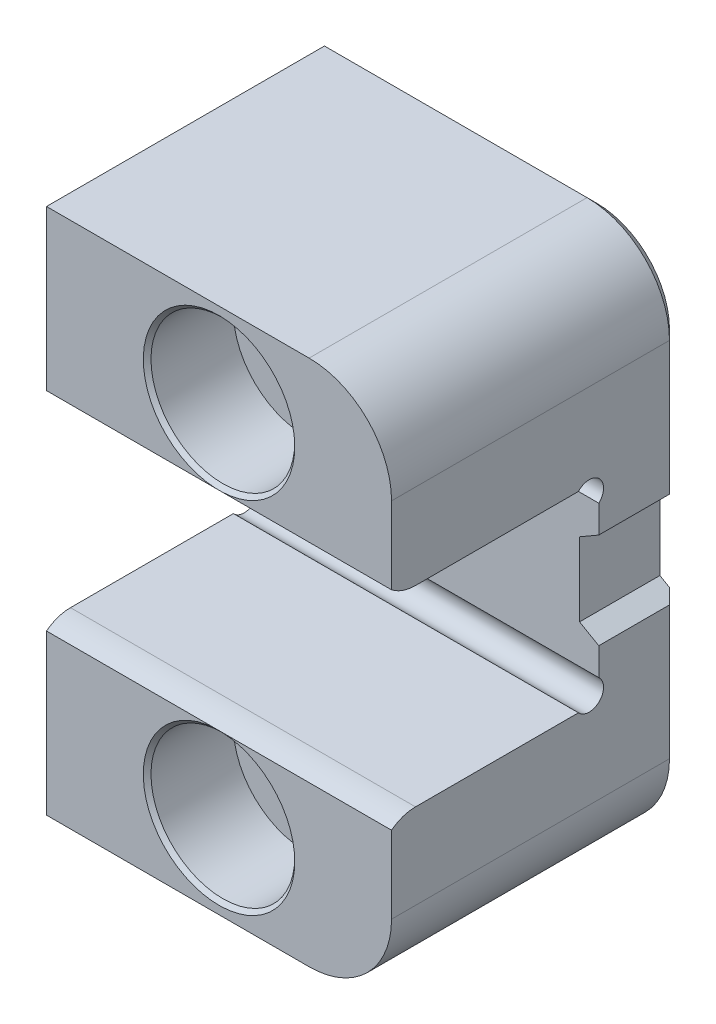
ISO-10303-21;
HEADER;
FILE_DESCRIPTION(('STEP AP214'),'2;1');
FILE_NAME('part.step','',(''),(''),'','','');
FILE_SCHEMA(('AUTOMOTIVE_DESIGN { 1 0 10303 214 1 1 1 1 }'));
ENDSEC;
DATA;
#1=APPLICATION_CONTEXT('core data for automotive mechanical design processes');
#2=APPLICATION_PROTOCOL_DEFINITION('international standard','automotive_design',2000,#1);
#3=PRODUCT_CONTEXT('',#1,'mechanical');
#4=PRODUCT('Part','Part','',(#3));
#5=PRODUCT_RELATED_PRODUCT_CATEGORY('part','',(#4));
#6=PRODUCT_DEFINITION_FORMATION('','',#4);
#7=PRODUCT_DEFINITION_CONTEXT('part definition',#1,'design');
#8=PRODUCT_DEFINITION('design','',#6,#7);
#9=PRODUCT_DEFINITION_SHAPE('','',#8);
#10=(LENGTH_UNIT() NAMED_UNIT(*) SI_UNIT(.MILLI.,.METRE.));
#11=(NAMED_UNIT(*) PLANE_ANGLE_UNIT() SI_UNIT($,.RADIAN.));
#12=(NAMED_UNIT(*) SI_UNIT($,.STERADIAN.) SOLID_ANGLE_UNIT());
#13=UNCERTAINTY_MEASURE_WITH_UNIT(LENGTH_MEASURE(1.E-05),#10,'distance_accuracy_value','');
#14=(GEOMETRIC_REPRESENTATION_CONTEXT(3) GLOBAL_UNCERTAINTY_ASSIGNED_CONTEXT((#13)) GLOBAL_UNIT_ASSIGNED_CONTEXT((#10,
#11,#12)) REPRESENTATION_CONTEXT('',''));
#15=CARTESIAN_POINT('',(0.,0.,0.));
#16=DIRECTION('',(0.,0.,1.));
#17=DIRECTION('',(1.,0.,0.));
#18=AXIS2_PLACEMENT_3D('',#15,#16,#17);
#19=CARTESIAN_POINT('',(18.,-27.5,0.));
#20=DIRECTION('',(1.,0.,0.));
#21=DIRECTION('',(0.,0.,-1.));
#22=AXIS2_PLACEMENT_3D('',#19,#20,#21);
#23=PLANE('',#22);
#24=DIRECTION('',(0.,0.,-1.));
#25=VECTOR('',#24,1.);
#26=CARTESIAN_POINT('',(18.,-18.9,-30.));
#27=LINE('',#26,#25);
#28=CARTESIAN_POINT('',(18.,-18.9,0.));
#29=VERTEX_POINT('',#28);
#30=CARTESIAN_POINT('',(18.,-18.9,-29.));
#31=VERTEX_POINT('',#30);
#32=EDGE_CURVE('E247',#29,#31,#27,.T.);
#33=ORIENTED_EDGE('',*,*,#32,.T.);
#34=DIRECTION('',(0.,1.,0.));
#35=VECTOR('',#34,1.);
#36=CARTESIAN_POINT('',(18.,-5.,-29.));
#37=LINE('',#36,#35);
#38=CARTESIAN_POINT('',(18.,-5.,-29.));
#39=VERTEX_POINT('',#38);
#40=EDGE_CURVE('E263',#31,#39,#37,.T.);
#41=ORIENTED_EDGE('',*,*,#40,.T.);
#42=DIRECTION('',(0.,0.,1.));
#43=VECTOR('',#42,1.);
#44=CARTESIAN_POINT('',(18.,-5.,-30.));
#45=LINE('',#44,#43);
#46=CARTESIAN_POINT('',(18.,-5.,-21.62));
#47=VERTEX_POINT('',#46);
#48=EDGE_CURVE('E435',#39,#47,#45,.T.);
#49=ORIENTED_EDGE('',*,*,#48,.T.);
#50=DIRECTION('',(0.,-1.,0.));
#51=VECTOR('',#50,1.);
#52=CARTESIAN_POINT('',(18.,10.,-21.62));
#53=LINE('',#52,#51);
#54=CARTESIAN_POINT('',(18.,-7.8819660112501,-21.62));
#55=VERTEX_POINT('',#54);
#56=EDGE_CURVE('E467',#47,#55,#53,.T.);
#57=ORIENTED_EDGE('',*,*,#56,.T.);
#58=CARTESIAN_POINT('',(18.,-9.,-20.62));
#59=DIRECTION('',(1.,0.,0.));
#60=DIRECTION('',(0.,0.,1.));
#61=AXIS2_PLACEMENT_3D('',#58,#59,#60);
#62=CIRCLE('',#61,1.5);
#63=CARTESIAN_POINT('',(18.,-10.,-19.5019660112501));
#64=VERTEX_POINT('',#63);
#65=EDGE_CURVE('E206',#64,#55,#62,.T.);
#66=ORIENTED_EDGE('',*,*,#65,.F.);
#67=DIRECTION('',(0.,0.,1.));
#68=VECTOR('',#67,1.);
#69=CARTESIAN_POINT('',(18.,-10.,-21.62));
#70=LINE('',#69,#68);
#71=CARTESIAN_POINT('',(18.,-10.,-2.49999999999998));
#72=VERTEX_POINT('',#71);
#73=EDGE_CURVE('E214',#64,#72,#70,.T.);
#74=ORIENTED_EDGE('',*,*,#73,.T.);
#75=CARTESIAN_POINT('',(18.,-14.0673190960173,-2.49999998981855));
#76=DIRECTION('',(-1.,0.,0.));
#77=DIRECTION('',(0.,0.,1.));
#78=AXIS2_PLACEMENT_3D('',#75,#76,#77);
#79=CIRCLE('',#78,4.06731909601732);
#80=CARTESIAN_POINT('',(18.,-10.859035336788,0.));
#81=VERTEX_POINT('',#80);
#82=EDGE_CURVE('E502',#81,#72,#79,.T.);
#83=ORIENTED_EDGE('',*,*,#82,.F.);
#84=DIRECTION('',(0.,-1.,0.));
#85=VECTOR('',#84,1.);
#86=CARTESIAN_POINT('',(18.,-10.,0.));
#87=LINE('',#86,#85);
#88=EDGE_CURVE('E242',#81,#29,#87,.T.);
#89=ORIENTED_EDGE('',*,*,#88,.T.);
#90=EDGE_LOOP('',(#33,#41,#49,#57,#66,#74,#83,#89));
#91=FACE_BOUND('',#90,.T.);
#92=ADVANCED_FACE('F33',(#91),#23,.T.);
#93=CARTESIAN_POINT('',(18.,27.5,0.));
#94=DIRECTION('',(0.,0.,-1.));
#95=DIRECTION('',(0.,1.,0.));
#96=AXIS2_PLACEMENT_3D('',#93,#94,#95);
#97=PLANE('',#96);
#98=DIRECTION('',(1.,0.,0.));
#99=VECTOR('',#98,1.);
#100=CARTESIAN_POINT('',(-18.,10.859035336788,0.));
#101=LINE('',#100,#99);
#102=CARTESIAN_POINT('',(-18.,10.859035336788,0.));
#103=VERTEX_POINT('',#102);
#104=CARTESIAN_POINT('',(-0.377725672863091,10.859035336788,0.));
#105=VERTEX_POINT('',#104);
#106=EDGE_CURVE('E503',#103,#105,#101,.T.);
#107=ORIENTED_EDGE('',*,*,#106,.T.);
#108=CARTESIAN_POINT('',(0.,18.75,0.));
#109=DIRECTION('',(0.,0.,-1.));
#110=DIRECTION('',(0.,1.,0.));
#111=AXIS2_PLACEMENT_3D('',#108,#109,#110);
#112=CIRCLE('',#111,7.9);
#113=CARTESIAN_POINT('',(0.377725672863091,10.859035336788,0.));
#114=VERTEX_POINT('',#113);
#115=EDGE_CURVE('E46',#105,#114,#112,.T.);
#116=ORIENTED_EDGE('',*,*,#115,.T.);
#117=CARTESIAN_POINT('',(18.,10.859035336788,0.));
#118=VERTEX_POINT('',#117);
#119=EDGE_CURVE('E498',#114,#118,#101,.T.);
#120=ORIENTED_EDGE('',*,*,#119,.T.);
#121=DIRECTION('',(0.,-1.,0.));
#122=VECTOR('',#121,1.);
#123=CARTESIAN_POINT('',(18.,27.5,0.));
#124=LINE('',#123,#122);
#125=CARTESIAN_POINT('',(18.,18.9,0.));
#126=VERTEX_POINT('',#125);
#127=EDGE_CURVE('E237',#126,#118,#124,.T.);
#128=ORIENTED_EDGE('',*,*,#127,.F.);
#129=CARTESIAN_POINT('',(9.4,18.9,0.));
#130=DIRECTION('',(0.,0.,-1.));
#131=DIRECTION('',(0.,1.,0.));
#132=AXIS2_PLACEMENT_3D('',#129,#130,#131);
#133=CIRCLE('',#132,8.6);
#134=CARTESIAN_POINT('',(9.4,27.5,0.));
#135=VERTEX_POINT('',#134);
#136=EDGE_CURVE('E255',#126,#135,#133,.F.);
#137=ORIENTED_EDGE('',*,*,#136,.T.);
#138=DIRECTION('',(-1.,0.,0.));
#139=VECTOR('',#138,1.);
#140=CARTESIAN_POINT('',(18.,27.5,0.));
#141=LINE('',#140,#139);
#142=CARTESIAN_POINT('',(-18.,27.5,0.));
#143=VERTEX_POINT('',#142);
#144=EDGE_CURVE('E238',#135,#143,#141,.T.);
#145=ORIENTED_EDGE('',*,*,#144,.T.);
#146=DIRECTION('',(0.,-1.,0.));
#147=VECTOR('',#146,1.);
#148=CARTESIAN_POINT('',(-18.,27.5,0.));
#149=LINE('',#148,#147);
#150=EDGE_CURVE('E461',#143,#103,#149,.T.);
#151=ORIENTED_EDGE('',*,*,#150,.T.);
#152=EDGE_LOOP('',(#107,#116,#120,#128,#137,#145,#151));
#153=FACE_BOUND('',#152,.T.);
#154=ADVANCED_FACE('F378',(#153),#97,.F.);
#155=CARTESIAN_POINT('',(18.,10.,0.));
#156=DIRECTION('',(0.,1.,0.));
#157=DIRECTION('',(0.,0.,1.));
#158=AXIS2_PLACEMENT_3D('',#155,#156,#157);
#159=PLANE('',#158);
#160=DIRECTION('',(0.,0.,-1.));
#161=VECTOR('',#160,1.);
#162=CARTESIAN_POINT('',(-18.,10.,0.));
#163=LINE('',#162,#161);
#164=CARTESIAN_POINT('',(-18.,10.,-2.49999999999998));
#165=VERTEX_POINT('',#164);
#166=CARTESIAN_POINT('',(-18.,10.,-19.5019660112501));
#167=VERTEX_POINT('',#166);
#168=EDGE_CURVE('E226',#165,#167,#163,.T.);
#169=ORIENTED_EDGE('',*,*,#168,.T.);
#170=DIRECTION('',(1.,0.,0.));
#171=VECTOR('',#170,1.);
#172=CARTESIAN_POINT('',(-18.,10.,-19.5019660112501));
#173=LINE('',#172,#171);
#174=CARTESIAN_POINT('',(18.,10.,-19.5019660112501));
#175=VERTEX_POINT('',#174);
#176=EDGE_CURVE('E479',#167,#175,#173,.T.);
#177=ORIENTED_EDGE('',*,*,#176,.T.);
#178=DIRECTION('',(0.,0.,-1.));
#179=VECTOR('',#178,1.);
#180=CARTESIAN_POINT('',(18.,10.,0.));
#181=LINE('',#180,#179);
#182=CARTESIAN_POINT('',(18.,10.,-2.49999999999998));
#183=VERTEX_POINT('',#182);
#184=EDGE_CURVE('E464',#183,#175,#181,.T.);
#185=ORIENTED_EDGE('',*,*,#184,.F.);
#186=DIRECTION('',(1.,0.,0.));
#187=VECTOR('',#186,1.);
#188=CARTESIAN_POINT('',(-18.,10.,-2.49999999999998));
#189=LINE('',#188,#187);
#190=EDGE_CURVE('E480',#165,#183,#189,.T.);
#191=ORIENTED_EDGE('',*,*,#190,.F.);
#192=EDGE_LOOP('',(#169,#177,#185,#191));
#193=FACE_BOUND('',#192,.T.);
#194=ADVANCED_FACE('F374',(#193),#159,.F.);
#195=CARTESIAN_POINT('',(18.,10.,-21.62));
#196=DIRECTION('',(0.,0.,-1.));
#197=DIRECTION('',(-1.,0.,0.));
#198=AXIS2_PLACEMENT_3D('',#195,#196,#197);
#199=PLANE('',#198);
#200=DIRECTION('',(0.,-1.,0.));
#201=VECTOR('',#200,1.);
#202=CARTESIAN_POINT('',(-18.,10.,-21.62));
#203=LINE('',#202,#201);
#204=CARTESIAN_POINT('',(-18.,7.8819660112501,-21.62));
#205=VERTEX_POINT('',#204);
#206=CARTESIAN_POINT('',(-18.,-7.8819660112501,-21.62));
#207=VERTEX_POINT('',#206);
#208=EDGE_CURVE('E222',#205,#207,#203,.T.);
#209=ORIENTED_EDGE('',*,*,#208,.T.);
#210=DIRECTION('',(1.,0.,0.));
#211=VECTOR('',#210,1.);
#212=CARTESIAN_POINT('',(-18.,-7.8819660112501,-21.62));
#213=LINE('',#212,#211);
#214=EDGE_CURVE('E201',#207,#55,#213,.T.);
#215=ORIENTED_EDGE('',*,*,#214,.T.);
#216=ORIENTED_EDGE('',*,*,#56,.F.);
#217=DIRECTION('',(-0.866025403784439,0.5,0.));
#218=VECTOR('',#217,1.);
#219=CARTESIAN_POINT('',(11.5048094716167,-1.25,-21.62));
#220=LINE('',#219,#218);
#221=CARTESIAN_POINT('',(16.,-3.84529946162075,-21.62));
#222=VERTEX_POINT('',#221);
#223=EDGE_CURVE('E455',#47,#222,#220,.T.);
#224=ORIENTED_EDGE('',*,*,#223,.T.);
#225=DIRECTION('',(0.,1.,0.));
#226=VECTOR('',#225,1.);
#227=CARTESIAN_POINT('',(16.,10.,-21.62));
#228=LINE('',#227,#226);
#229=CARTESIAN_POINT('',(16.,3.84529946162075,-21.62));
#230=VERTEX_POINT('',#229);
#231=EDGE_CURVE('E458',#222,#230,#228,.T.);
#232=ORIENTED_EDGE('',*,*,#231,.T.);
#233=DIRECTION('',(0.866025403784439,0.5,0.));
#234=VECTOR('',#233,1.);
#235=CARTESIAN_POINT('',(20.1650635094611,6.25,-21.62));
#236=LINE('',#235,#234);
#237=CARTESIAN_POINT('',(18.,5.,-21.62));
#238=VERTEX_POINT('',#237);
#239=EDGE_CURVE('E448',#230,#238,#236,.T.);
#240=ORIENTED_EDGE('',*,*,#239,.T.);
#241=CARTESIAN_POINT('',(18.,7.8819660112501,-21.62));
#242=VERTEX_POINT('',#241);
#243=EDGE_CURVE('E468',#242,#238,#53,.T.);
#244=ORIENTED_EDGE('',*,*,#243,.F.);
#245=DIRECTION('',(1.,0.,0.));
#246=VECTOR('',#245,1.);
#247=CARTESIAN_POINT('',(-18.,7.8819660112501,-21.62));
#248=LINE('',#247,#246);
#249=EDGE_CURVE('E487',#242,#205,#248,.F.);
#250=ORIENTED_EDGE('',*,*,#249,.T.);
#251=EDGE_LOOP('',(#209,#215,#216,#224,#232,#240,#244,#250));
#252=FACE_BOUND('',#251,.T.);
#253=ADVANCED_FACE('F371',(#252),#199,.F.);
#254=CARTESIAN_POINT('',(18.,-10.,-21.62));
#255=DIRECTION('',(0.,-1.,0.));
#256=DIRECTION('',(0.,0.,-1.));
#257=AXIS2_PLACEMENT_3D('',#254,#255,#256);
#258=PLANE('',#257);
#259=ORIENTED_EDGE('',*,*,#73,.F.);
#260=DIRECTION('',(1.,0.,0.));
#261=VECTOR('',#260,1.);
#262=CARTESIAN_POINT('',(-18.,-10.,-19.5019660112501));
#263=LINE('',#262,#261);
#264=CARTESIAN_POINT('',(-18.,-10.,-19.5019660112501));
#265=VERTEX_POINT('',#264);
#266=EDGE_CURVE('E198',#64,#265,#263,.F.);
#267=ORIENTED_EDGE('',*,*,#266,.T.);
#268=DIRECTION('',(0.,0.,1.));
#269=VECTOR('',#268,1.);
#270=CARTESIAN_POINT('',(-18.,-10.,-21.62));
#271=LINE('',#270,#269);
#272=CARTESIAN_POINT('',(-18.,-10.,-2.49999999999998));
#273=VERTEX_POINT('',#272);
#274=EDGE_CURVE('E212',#265,#273,#271,.T.);
#275=ORIENTED_EDGE('',*,*,#274,.T.);
#276=DIRECTION('',(1.,0.,0.));
#277=VECTOR('',#276,1.);
#278=CARTESIAN_POINT('',(-18.,-10.,-2.49999999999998));
#279=LINE('',#278,#277);
#280=EDGE_CURVE('E506',#273,#72,#279,.T.);
#281=ORIENTED_EDGE('',*,*,#280,.T.);
#282=EDGE_LOOP('',(#259,#267,#275,#281));
#283=FACE_BOUND('',#282,.T.);
#284=ADVANCED_FACE('F210',(#283),#258,.F.);
#285=CARTESIAN_POINT('',(18.,-10.,0.));
#286=DIRECTION('',(0.,0.,-1.));
#287=DIRECTION('',(0.,1.,0.));
#288=AXIS2_PLACEMENT_3D('',#285,#286,#287);
#289=PLANE('',#288);
#290=DIRECTION('',(1.,0.,0.));
#291=VECTOR('',#290,1.);
#292=CARTESIAN_POINT('',(-18.,-10.859035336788,0.));
#293=LINE('',#292,#291);
#294=CARTESIAN_POINT('',(0.377725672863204,-10.859035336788,0.));
#295=VERTEX_POINT('',#294);
#296=EDGE_CURVE('E512',#295,#81,#293,.T.);
#297=ORIENTED_EDGE('',*,*,#296,.F.);
#298=CARTESIAN_POINT('',(0.,-18.75,0.));
#299=DIRECTION('',(0.,0.,-1.));
#300=DIRECTION('',(0.,1.,0.));
#301=AXIS2_PLACEMENT_3D('',#298,#299,#300);
#302=CIRCLE('',#301,7.9);
#303=CARTESIAN_POINT('',(-0.377725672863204,-10.859035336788,0.));
#304=VERTEX_POINT('',#303);
#305=EDGE_CURVE('E312',#295,#304,#302,.T.);
#306=ORIENTED_EDGE('',*,*,#305,.T.);
#307=CARTESIAN_POINT('',(-18.,-10.859035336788,0.));
#308=VERTEX_POINT('',#307);
#309=EDGE_CURVE('E509',#308,#304,#293,.T.);
#310=ORIENTED_EDGE('',*,*,#309,.F.);
#311=DIRECTION('',(0.,-1.,0.));
#312=VECTOR('',#311,1.);
#313=CARTESIAN_POINT('',(-18.,-10.,0.));
#314=LINE('',#313,#312);
#315=CARTESIAN_POINT('',(-18.,-27.5,0.));
#316=VERTEX_POINT('',#315);
#317=EDGE_CURVE('E221',#308,#316,#314,.T.);
#318=ORIENTED_EDGE('',*,*,#317,.T.);
#319=DIRECTION('',(-1.,0.,0.));
#320=VECTOR('',#319,1.);
#321=CARTESIAN_POINT('',(18.,-27.5,0.));
#322=LINE('',#321,#320);
#323=CARTESIAN_POINT('',(9.4,-27.5,0.));
#324=VERTEX_POINT('',#323);
#325=EDGE_CURVE('E241',#324,#316,#322,.T.);
#326=ORIENTED_EDGE('',*,*,#325,.F.);
#327=CARTESIAN_POINT('',(9.4,-18.9,0.));
#328=DIRECTION('',(0.,0.,-1.));
#329=DIRECTION('',(0.,1.,0.));
#330=AXIS2_PLACEMENT_3D('',#327,#328,#329);
#331=CIRCLE('',#330,8.6);
#332=EDGE_CURVE('E252',#324,#29,#331,.F.);
#333=ORIENTED_EDGE('',*,*,#332,.T.);
#334=ORIENTED_EDGE('',*,*,#88,.F.);
#335=EDGE_LOOP('',(#297,#306,#310,#318,#326,#333,#334));
#336=FACE_BOUND('',#335,.T.);
#337=ADVANCED_FACE('F364',(#336),#289,.F.);
#338=CARTESIAN_POINT('',(18.,-27.5,0.));
#339=DIRECTION('',(0.,1.,0.));
#340=DIRECTION('',(0.,0.,1.));
#341=AXIS2_PLACEMENT_3D('',#338,#339,#340);
#342=PLANE('',#341);
#343=DIRECTION('',(0.,0.,-1.));
#344=VECTOR('',#343,1.);
#345=CARTESIAN_POINT('',(-18.,-27.5,0.));
#346=LINE('',#345,#344);
#347=CARTESIAN_POINT('',(-18.,-27.5,-29.));
#348=VERTEX_POINT('',#347);
#349=EDGE_CURVE('E224',#316,#348,#346,.T.);
#350=ORIENTED_EDGE('',*,*,#349,.T.);
#351=DIRECTION('',(1.,0.,0.));
#352=VECTOR('',#351,1.);
#353=CARTESIAN_POINT('',(18.,-27.5,-29.));
#354=LINE('',#353,#352);
#355=CARTESIAN_POINT('',(9.4,-27.5,-29.));
#356=VERTEX_POINT('',#355);
#357=EDGE_CURVE('E286',#348,#356,#354,.T.);
#358=ORIENTED_EDGE('',*,*,#357,.T.);
#359=DIRECTION('',(0.,0.,-1.));
#360=VECTOR('',#359,1.);
#361=CARTESIAN_POINT('',(9.4,-27.5,0.));
#362=LINE('',#361,#360);
#363=EDGE_CURVE('E250',#356,#324,#362,.F.);
#364=ORIENTED_EDGE('',*,*,#363,.T.);
#365=ORIENTED_EDGE('',*,*,#325,.T.);
#366=EDGE_LOOP('',(#350,#358,#364,#365));
#367=FACE_BOUND('',#366,.T.);
#368=ADVANCED_FACE('F360',(#367),#342,.F.);
#369=CARTESIAN_POINT('',(18.,27.5,-30.));
#370=DIRECTION('',(0.,0.,1.));
#371=DIRECTION('',(1.,0.,0.));
#372=AXIS2_PLACEMENT_3D('',#369,#370,#371);
#373=PLANE('',#372);
#374=CARTESIAN_POINT('',(0.,18.75,-30.));
#375=DIRECTION('',(0.,0.,1.));
#376=DIRECTION('',(1.,0.,0.));
#377=AXIS2_PLACEMENT_3D('',#374,#375,#376);
#378=CIRCLE('',#377,4.49999999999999);
#379=CARTESIAN_POINT('',(4.49999999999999,18.75,-30.));
#380=VERTEX_POINT('',#379);
#381=EDGE_CURVE('E530',#380,#380,#378,.T.);
#382=ORIENTED_EDGE('',*,*,#381,.T.);
#383=EDGE_LOOP('',(#382));
#384=FACE_BOUND('',#383,.T.);
#385=CARTESIAN_POINT('',(0.,-18.75,-30.));
#386=DIRECTION('',(0.,0.,1.));
#387=DIRECTION('',(1.,0.,0.));
#388=AXIS2_PLACEMENT_3D('',#385,#386,#387);
#389=CIRCLE('',#388,4.49999999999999);
#390=CARTESIAN_POINT('',(4.49999999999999,-18.75,-30.));
#391=VERTEX_POINT('',#390);
#392=EDGE_CURVE('E519',#391,#391,#389,.T.);
#393=ORIENTED_EDGE('',*,*,#392,.T.);
#394=EDGE_LOOP('',(#393));
#395=FACE_BOUND('',#394,.T.);
#396=DIRECTION('',(0.866025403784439,-0.5,0.));
#397=VECTOR('',#396,1.);
#398=CARTESIAN_POINT('',(18.,-5.,-30.));
#399=LINE('',#398,#397);
#400=CARTESIAN_POINT('',(16.,-3.84529946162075,-30.));
#401=VERTEX_POINT('',#400);
#402=CARTESIAN_POINT('',(17.,-4.42264973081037,-30.));
#403=VERTEX_POINT('',#402);
#404=EDGE_CURVE('E432',#401,#403,#399,.T.);
#405=ORIENTED_EDGE('',*,*,#404,.T.);
#406=DIRECTION('',(0.,-1.,0.));
#407=VECTOR('',#406,1.);
#408=CARTESIAN_POINT('',(17.,-18.9,-30.));
#409=LINE('',#408,#407);
#410=CARTESIAN_POINT('',(17.,-18.9,-30.));
#411=VERTEX_POINT('',#410);
#412=EDGE_CURVE('E278',#403,#411,#409,.T.);
#413=ORIENTED_EDGE('',*,*,#412,.T.);
#414=CARTESIAN_POINT('',(9.4,-18.9,-30.));
#415=DIRECTION('',(0.,0.,1.));
#416=DIRECTION('',(1.,0.,0.));
#417=AXIS2_PLACEMENT_3D('',#414,#415,#416);
#418=CIRCLE('',#417,7.59999999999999);
#419=CARTESIAN_POINT('',(9.4,-26.5,-30.));
#420=VERTEX_POINT('',#419);
#421=EDGE_CURVE('E276',#411,#420,#418,.F.);
#422=ORIENTED_EDGE('',*,*,#421,.T.);
#423=DIRECTION('',(-1.,0.,0.));
#424=VECTOR('',#423,1.);
#425=CARTESIAN_POINT('',(18.,-26.5,-30.));
#426=LINE('',#425,#424);
#427=CARTESIAN_POINT('',(-18.,-26.5,-30.));
#428=VERTEX_POINT('',#427);
#429=EDGE_CURVE('E274',#420,#428,#426,.T.);
#430=ORIENTED_EDGE('',*,*,#429,.T.);
#431=DIRECTION('',(0.,1.,0.));
#432=VECTOR('',#431,1.);
#433=CARTESIAN_POINT('',(-18.,27.5,-30.));
#434=LINE('',#433,#432);
#435=CARTESIAN_POINT('',(-18.,26.5,-30.));
#436=VERTEX_POINT('',#435);
#437=EDGE_CURVE('E232',#428,#436,#434,.T.);
#438=ORIENTED_EDGE('',*,*,#437,.T.);
#439=DIRECTION('',(1.,0.,0.));
#440=VECTOR('',#439,1.);
#441=CARTESIAN_POINT('',(18.,26.5,-30.));
#442=LINE('',#441,#440);
#443=CARTESIAN_POINT('',(9.4,26.5,-30.));
#444=VERTEX_POINT('',#443);
#445=EDGE_CURVE('E268',#436,#444,#442,.T.);
#446=ORIENTED_EDGE('',*,*,#445,.T.);
#447=CARTESIAN_POINT('',(9.4,18.9,-30.));
#448=DIRECTION('',(0.,0.,1.));
#449=DIRECTION('',(1.,0.,0.));
#450=AXIS2_PLACEMENT_3D('',#447,#448,#449);
#451=CIRCLE('',#450,7.6);
#452=CARTESIAN_POINT('',(17.,18.9,-30.));
#453=VERTEX_POINT('',#452);
#454=EDGE_CURVE('E270',#444,#453,#451,.F.);
#455=ORIENTED_EDGE('',*,*,#454,.T.);
#456=DIRECTION('',(0.,-1.,0.));
#457=VECTOR('',#456,1.);
#458=CARTESIAN_POINT('',(17.,5.,-30.));
#459=LINE('',#458,#457);
#460=CARTESIAN_POINT('',(17.,4.42264973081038,-30.));
#461=VERTEX_POINT('',#460);
#462=EDGE_CURVE('E272',#453,#461,#459,.T.);
#463=ORIENTED_EDGE('',*,*,#462,.T.);
#464=DIRECTION('',(-0.866025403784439,-0.5,0.));
#465=VECTOR('',#464,1.);
#466=CARTESIAN_POINT('',(18.,5.,-30.));
#467=LINE('',#466,#465);
#468=CARTESIAN_POINT('',(16.,3.84529946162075,-30.));
#469=VERTEX_POINT('',#468);
#470=EDGE_CURVE('E443',#461,#469,#467,.T.);
#471=ORIENTED_EDGE('',*,*,#470,.T.);
#472=DIRECTION('',(0.,-1.,0.));
#473=VECTOR('',#472,1.);
#474=CARTESIAN_POINT('',(16.,-3.84529946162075,-30.));
#475=LINE('',#474,#473);
#476=EDGE_CURVE('E438',#469,#401,#475,.T.);
#477=ORIENTED_EDGE('',*,*,#476,.T.);
#478=EDGE_LOOP('',(#405,#413,#422,#430,#438,#446,#455,#463,#471,#477));
#479=FACE_BOUND('',#478,.T.);
#480=ADVANCED_FACE('F356',(#384,#395,#479),#373,.F.);
#481=CARTESIAN_POINT('',(18.,27.5,0.));
#482=DIRECTION('',(0.,-1.,0.));
#483=DIRECTION('',(0.,0.,-1.));
#484=AXIS2_PLACEMENT_3D('',#481,#482,#483);
#485=PLANE('',#484);
#486=DIRECTION('',(0.,0.,1.));
#487=VECTOR('',#486,1.);
#488=CARTESIAN_POINT('',(9.4,27.5,-30.));
#489=LINE('',#488,#487);
#490=CARTESIAN_POINT('',(9.4,27.5,-29.));
#491=VERTEX_POINT('',#490);
#492=EDGE_CURVE('E257',#135,#491,#489,.F.);
#493=ORIENTED_EDGE('',*,*,#492,.T.);
#494=DIRECTION('',(-1.,0.,0.));
#495=VECTOR('',#494,1.);
#496=CARTESIAN_POINT('',(18.,27.5,-29.));
#497=LINE('',#496,#495);
#498=CARTESIAN_POINT('',(-18.,27.5,-29.));
#499=VERTEX_POINT('',#498);
#500=EDGE_CURVE('E295',#491,#499,#497,.T.);
#501=ORIENTED_EDGE('',*,*,#500,.T.);
#502=DIRECTION('',(0.,0.,1.));
#503=VECTOR('',#502,1.);
#504=CARTESIAN_POINT('',(-18.,27.5,0.));
#505=LINE('',#504,#503);
#506=EDGE_CURVE('E235',#499,#143,#505,.T.);
#507=ORIENTED_EDGE('',*,*,#506,.T.);
#508=ORIENTED_EDGE('',*,*,#144,.F.);
#509=EDGE_LOOP('',(#493,#501,#507,#508));
#510=FACE_BOUND('',#509,.T.);
#511=ADVANCED_FACE('F349',(#510),#485,.F.);
#512=DIRECTION('',(0.,0.,1.));
#513=VECTOR('',#512,1.);
#514=CARTESIAN_POINT('',(18.,5.,-30.));
#515=LINE('',#514,#513);
#516=CARTESIAN_POINT('',(18.,5.,-29.));
#517=VERTEX_POINT('',#516);
#518=EDGE_CURVE('E439',#517,#238,#515,.T.);
#519=ORIENTED_EDGE('',*,*,#518,.F.);
#520=DIRECTION('',(0.,1.,0.));
#521=VECTOR('',#520,1.);
#522=CARTESIAN_POINT('',(18.,18.9,-29.));
#523=LINE('',#522,#521);
#524=CARTESIAN_POINT('',(18.,18.9,-29.));
#525=VERTEX_POINT('',#524);
#526=EDGE_CURVE('E288',#517,#525,#523,.T.);
#527=ORIENTED_EDGE('',*,*,#526,.T.);
#528=DIRECTION('',(0.,0.,1.));
#529=VECTOR('',#528,1.);
#530=CARTESIAN_POINT('',(18.,18.9,0.));
#531=LINE('',#530,#529);
#532=EDGE_CURVE('E245',#525,#126,#531,.T.);
#533=ORIENTED_EDGE('',*,*,#532,.T.);
#534=ORIENTED_EDGE('',*,*,#127,.T.);
#535=CARTESIAN_POINT('',(18.,14.0673190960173,-2.49999998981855));
#536=DIRECTION('',(-1.,0.,0.));
#537=DIRECTION('',(0.,0.,-1.));
#538=AXIS2_PLACEMENT_3D('',#535,#536,#537);
#539=CIRCLE('',#538,4.06731909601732);
#540=EDGE_CURVE('E492',#183,#118,#539,.T.);
#541=ORIENTED_EDGE('',*,*,#540,.F.);
#542=ORIENTED_EDGE('',*,*,#184,.T.);
#543=CARTESIAN_POINT('',(18.,9.,-20.62));
#544=DIRECTION('',(1.,0.,0.));
#545=DIRECTION('',(0.,0.,-1.));
#546=AXIS2_PLACEMENT_3D('',#543,#544,#545);
#547=CIRCLE('',#546,1.5);
#548=EDGE_CURVE('E490',#242,#175,#547,.T.);
#549=ORIENTED_EDGE('',*,*,#548,.F.);
#550=ORIENTED_EDGE('',*,*,#243,.T.);
#551=EDGE_LOOP('',(#519,#527,#533,#534,#541,#542,#549,#550));
#552=FACE_BOUND('',#551,.T.);
#553=ADVANCED_FACE('F346',(#552),#23,.T.);
#554=CARTESIAN_POINT('',(-18.,-27.5,0.));
#555=DIRECTION('',(1.,0.,0.));
#556=DIRECTION('',(0.,0.,-1.));
#557=AXIS2_PLACEMENT_3D('',#554,#555,#556);
#558=PLANE('',#557);
#559=ORIENTED_EDGE('',*,*,#437,.F.);
#560=DIRECTION('',(0.,0.707106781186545,-0.70710678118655));
#561=VECTOR('',#560,1.);
#562=CARTESIAN_POINT('',(-18.,-26.5,-30.));
#563=LINE('',#562,#561);
#564=EDGE_CURVE('E284',#428,#348,#563,.F.);
#565=ORIENTED_EDGE('',*,*,#564,.T.);
#566=ORIENTED_EDGE('',*,*,#349,.F.);
#567=ORIENTED_EDGE('',*,*,#317,.F.);
#568=CARTESIAN_POINT('',(-18.,-14.0673190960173,-2.49999998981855));
#569=DIRECTION('',(-1.,0.,0.));
#570=DIRECTION('',(0.,0.,1.));
#571=AXIS2_PLACEMENT_3D('',#568,#569,#570);
#572=CIRCLE('',#571,4.06731909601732);
#573=EDGE_CURVE('E220',#308,#273,#572,.T.);
#574=ORIENTED_EDGE('',*,*,#573,.T.);
#575=ORIENTED_EDGE('',*,*,#274,.F.);
#576=CARTESIAN_POINT('',(-18.,-9.,-20.62));
#577=DIRECTION('',(1.,0.,0.));
#578=DIRECTION('',(0.,0.,1.));
#579=AXIS2_PLACEMENT_3D('',#576,#577,#578);
#580=CIRCLE('',#579,1.5);
#581=EDGE_CURVE('E195',#265,#207,#580,.T.);
#582=ORIENTED_EDGE('',*,*,#581,.T.);
#583=ORIENTED_EDGE('',*,*,#208,.F.);
#584=CARTESIAN_POINT('',(-18.,9.,-20.62));
#585=DIRECTION('',(1.,0.,0.));
#586=DIRECTION('',(0.,0.,-1.));
#587=AXIS2_PLACEMENT_3D('',#584,#585,#586);
#588=CIRCLE('',#587,1.5);
#589=EDGE_CURVE('E260',#205,#167,#588,.T.);
#590=ORIENTED_EDGE('',*,*,#589,.T.);
#591=ORIENTED_EDGE('',*,*,#168,.F.);
#592=CARTESIAN_POINT('',(-18.,14.0673190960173,-2.49999998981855));
#593=DIRECTION('',(-1.,0.,0.));
#594=DIRECTION('',(0.,0.,-1.));
#595=AXIS2_PLACEMENT_3D('',#592,#593,#594);
#596=CIRCLE('',#595,4.06731909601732);
#597=EDGE_CURVE('E483',#165,#103,#596,.T.);
#598=ORIENTED_EDGE('',*,*,#597,.T.);
#599=ORIENTED_EDGE('',*,*,#150,.F.);
#600=ORIENTED_EDGE('',*,*,#506,.F.);
#601=DIRECTION('',(0.,0.707106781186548,0.707106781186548));
#602=VECTOR('',#601,1.);
#603=CARTESIAN_POINT('',(-18.,27.5,-29.));
#604=LINE('',#603,#602);
#605=EDGE_CURVE('E282',#499,#436,#604,.F.);
#606=ORIENTED_EDGE('',*,*,#605,.T.);
#607=EDGE_LOOP('',(#559,#565,#566,#567,#574,#575,#582,#583,#590,#591,#598,#599,#600,#606));
#608=FACE_BOUND('',#607,.T.);
#609=ADVANCED_FACE('F218',(#608),#558,.F.);
#610=CARTESIAN_POINT('',(9.4,-18.9,0.));
#611=DIRECTION('',(0.,0.,1.));
#612=DIRECTION('',(1.,0.,0.));
#613=AXIS2_PLACEMENT_3D('',#610,#611,#612);
#614=CYLINDRICAL_SURFACE('',#613,8.6);
#615=ORIENTED_EDGE('',*,*,#363,.F.);
#616=CARTESIAN_POINT('',(9.4,-18.9,-29.));
#617=DIRECTION('',(0.,0.,1.));
#618=DIRECTION('',(1.,0.,0.));
#619=AXIS2_PLACEMENT_3D('',#616,#617,#618);
#620=CIRCLE('',#619,8.6);
#621=EDGE_CURVE('E280',#356,#31,#620,.T.);
#622=ORIENTED_EDGE('',*,*,#621,.T.);
#623=ORIENTED_EDGE('',*,*,#32,.F.);
#624=ORIENTED_EDGE('',*,*,#332,.F.);
#625=EDGE_LOOP('',(#615,#622,#623,#624));
#626=FACE_BOUND('',#625,.T.);
#627=ADVANCED_FACE('F353',(#626),#614,.T.);
#628=CARTESIAN_POINT('',(9.4,18.9,0.));
#629=DIRECTION('',(0.,0.,-1.));
#630=DIRECTION('',(-1.,0.,0.));
#631=AXIS2_PLACEMENT_3D('',#628,#629,#630);
#632=CYLINDRICAL_SURFACE('',#631,8.6);
#633=ORIENTED_EDGE('',*,*,#532,.F.);
#634=CARTESIAN_POINT('',(9.4,18.9,-29.));
#635=DIRECTION('',(0.,0.,1.));
#636=DIRECTION('',(1.,0.,0.));
#637=AXIS2_PLACEMENT_3D('',#634,#635,#636);
#638=CIRCLE('',#637,8.6);
#639=EDGE_CURVE('E293',#525,#491,#638,.T.);
#640=ORIENTED_EDGE('',*,*,#639,.T.);
#641=ORIENTED_EDGE('',*,*,#492,.F.);
#642=ORIENTED_EDGE('',*,*,#136,.F.);
#643=EDGE_LOOP('',(#633,#640,#641,#642));
#644=FACE_BOUND('',#643,.T.);
#645=ADVANCED_FACE('F341',(#644),#632,.T.);
#646=CARTESIAN_POINT('',(16.,-3.84529946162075,-30.));
#647=DIRECTION('',(-1.,0.,0.));
#648=DIRECTION('',(0.,0.,1.));
#649=AXIS2_PLACEMENT_3D('',#646,#647,#648);
#650=PLANE('',#649);
#651=DIRECTION('',(0.,0.,1.));
#652=VECTOR('',#651,1.);
#653=CARTESIAN_POINT('',(16.,-3.84529946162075,-30.));
#654=LINE('',#653,#652);
#655=EDGE_CURVE('E449',#401,#222,#654,.T.);
#656=ORIENTED_EDGE('',*,*,#655,.F.);
#657=ORIENTED_EDGE('',*,*,#476,.F.);
#658=DIRECTION('',(0.,0.,1.));
#659=VECTOR('',#658,1.);
#660=CARTESIAN_POINT('',(16.,3.84529946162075,-30.));
#661=LINE('',#660,#659);
#662=EDGE_CURVE('E441',#469,#230,#661,.T.);
#663=ORIENTED_EDGE('',*,*,#662,.T.);
#664=ORIENTED_EDGE('',*,*,#231,.F.);
#665=EDGE_LOOP('',(#656,#657,#663,#664));
#666=FACE_BOUND('',#665,.T.);
#667=ADVANCED_FACE('F337',(#666),#650,.F.);
#668=CARTESIAN_POINT('',(18.,-5.,-30.));
#669=DIRECTION('',(-0.5,-0.866025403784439,0.));
#670=DIRECTION('',(0.866025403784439,-0.5,0.));
#671=AXIS2_PLACEMENT_3D('',#668,#669,#670);
#672=PLANE('',#671);
#673=ORIENTED_EDGE('',*,*,#48,.F.);
#674=DIRECTION('',(-0.654653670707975,0.377964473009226,-0.65465367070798));
#675=VECTOR('',#674,1.);
#676=CARTESIAN_POINT('',(23.5673061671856,-8.2142857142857,-23.4326938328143));
#677=LINE('',#676,#675);
#678=EDGE_CURVE('E266',#39,#403,#677,.T.);
#679=ORIENTED_EDGE('',*,*,#678,.T.);
#680=ORIENTED_EDGE('',*,*,#404,.F.);
#681=ORIENTED_EDGE('',*,*,#655,.T.);
#682=ORIENTED_EDGE('',*,*,#223,.F.);
#683=EDGE_LOOP('',(#673,#679,#680,#681,#682));
#684=FACE_BOUND('',#683,.T.);
#685=ADVANCED_FACE('F334',(#684),#672,.F.);
#686=CARTESIAN_POINT('',(18.,5.,-30.));
#687=DIRECTION('',(-0.5,0.866025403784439,0.));
#688=DIRECTION('',(-0.866025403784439,-0.5,0.));
#689=AXIS2_PLACEMENT_3D('',#686,#687,#688);
#690=PLANE('',#689);
#691=ORIENTED_EDGE('',*,*,#470,.F.);
#692=DIRECTION('',(0.654653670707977,0.377964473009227,0.654653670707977));
#693=VECTOR('',#692,1.);
#694=CARTESIAN_POINT('',(9.95833553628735,0.357142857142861,-37.0416644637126));
#695=LINE('',#694,#693);
#696=EDGE_CURVE('E291',#461,#517,#695,.T.);
#697=ORIENTED_EDGE('',*,*,#696,.T.);
#698=ORIENTED_EDGE('',*,*,#518,.T.);
#699=ORIENTED_EDGE('',*,*,#239,.F.);
#700=ORIENTED_EDGE('',*,*,#662,.F.);
#701=EDGE_LOOP('',(#691,#697,#698,#699,#700));
#702=FACE_BOUND('',#701,.T.);
#703=ADVANCED_FACE('F330',(#702),#690,.F.);
#704=CARTESIAN_POINT('',(-18.,-14.0673190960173,-2.49999998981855));
#705=DIRECTION('',(1.,0.,0.));
#706=DIRECTION('',(0.,0.,-1.));
#707=AXIS2_PLACEMENT_3D('',#704,#705,#706);
#708=CYLINDRICAL_SURFACE('',#707,4.06731909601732);
#709=ORIENTED_EDGE('',*,*,#309,.T.);
#710=CARTESIAN_POINT('',(-0.377725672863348,-10.859035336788,0.));
#711=CARTESIAN_POINT('',(-0.251817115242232,-10.8563996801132,-0.00338790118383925));
#712=CARTESIAN_POINT('',(-0.125908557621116,-10.8550818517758,-0.00508185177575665));
#713=CARTESIAN_POINT('',(0.125908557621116,-10.8550818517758,-0.00508185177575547));
#714=CARTESIAN_POINT('',(0.251817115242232,-10.8563996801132,-0.00338790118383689));
#715=CARTESIAN_POINT('',(0.377725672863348,-10.859035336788,0.));
#716=B_SPLINE_CURVE_WITH_KNOTS('',3,(#710,#711,#712,#713,#714,#715),.UNSPECIFIED.,.F.,.F.,(4,2,
4),(0.,0.37778054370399,0.75556108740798),.UNSPECIFIED.);
#717=EDGE_CURVE('E315',#304,#295,#716,.T.);
#718=ORIENTED_EDGE('',*,*,#717,.T.);
#719=ORIENTED_EDGE('',*,*,#296,.T.);
#720=ORIENTED_EDGE('',*,*,#82,.T.);
#721=ORIENTED_EDGE('',*,*,#280,.F.);
#722=ORIENTED_EDGE('',*,*,#573,.F.);
#723=EDGE_LOOP('',(#709,#718,#719,#720,#721,#722));
#724=FACE_BOUND('',#723,.T.);
#725=ADVANCED_FACE('F325',(#724),#708,.T.);
#726=CARTESIAN_POINT('',(-18.,14.0673190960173,-2.49999998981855));
#727=DIRECTION('',(1.,0.,0.));
#728=DIRECTION('',(0.,0.,-1.));
#729=AXIS2_PLACEMENT_3D('',#726,#727,#728);
#730=CYLINDRICAL_SURFACE('',#729,4.06731909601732);
#731=ORIENTED_EDGE('',*,*,#119,.F.);
#732=CARTESIAN_POINT('',(0.377725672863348,10.859035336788,0.));
#733=CARTESIAN_POINT('',(0.251817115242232,10.8563996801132,-0.00338790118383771));
#734=CARTESIAN_POINT('',(0.125908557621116,10.8550818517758,-0.00508185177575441));
#735=CARTESIAN_POINT('',(-0.125908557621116,10.8550818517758,-0.0050818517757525));
#736=CARTESIAN_POINT('',(-0.251817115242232,10.8563996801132,-0.00338790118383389));
#737=CARTESIAN_POINT('',(-0.377725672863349,10.859035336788,0.));
#738=B_SPLINE_CURVE_WITH_KNOTS('',3,(#732,#733,#734,#735,#736,#737),.UNSPECIFIED.,.F.,.F.,(4,2,
4),(0.,0.37778054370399,0.75556108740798),.UNSPECIFIED.);
#739=EDGE_CURVE('E11',#114,#105,#738,.T.);
#740=ORIENTED_EDGE('',*,*,#739,.T.);
#741=ORIENTED_EDGE('',*,*,#106,.F.);
#742=ORIENTED_EDGE('',*,*,#597,.F.);
#743=ORIENTED_EDGE('',*,*,#190,.T.);
#744=ORIENTED_EDGE('',*,*,#540,.T.);
#745=EDGE_LOOP('',(#731,#740,#741,#742,#743,#744));
#746=FACE_BOUND('',#745,.T.);
#747=ADVANCED_FACE('F329',(#746),#730,.T.);
#748=CARTESIAN_POINT('',(-18.,9.,-20.62));
#749=DIRECTION('',(1.,0.,0.));
#750=DIRECTION('',(0.,0.,-1.));
#751=AXIS2_PLACEMENT_3D('',#748,#749,#750);
#752=CYLINDRICAL_SURFACE('',#751,1.5);
#753=ORIENTED_EDGE('',*,*,#589,.F.);
#754=ORIENTED_EDGE('',*,*,#249,.F.);
#755=ORIENTED_EDGE('',*,*,#548,.T.);
#756=ORIENTED_EDGE('',*,*,#176,.F.);
#757=EDGE_LOOP('',(#753,#754,#755,#756));
#758=FACE_BOUND('',#757,.T.);
#759=ADVANCED_FACE('F486',(#758),#752,.F.);
#760=CARTESIAN_POINT('',(-18.,-9.,-20.62));
#761=DIRECTION('',(1.,0.,0.));
#762=DIRECTION('',(0.,0.,-1.));
#763=AXIS2_PLACEMENT_3D('',#760,#761,#762);
#764=CYLINDRICAL_SURFACE('',#763,1.5);
#765=ORIENTED_EDGE('',*,*,#581,.F.);
#766=ORIENTED_EDGE('',*,*,#266,.F.);
#767=ORIENTED_EDGE('',*,*,#65,.T.);
#768=ORIENTED_EDGE('',*,*,#214,.F.);
#769=EDGE_LOOP('',(#765,#766,#767,#768));
#770=FACE_BOUND('',#769,.T.);
#771=ADVANCED_FACE('F197',(#770),#764,.F.);
#772=CARTESIAN_POINT('',(0.,-18.75,0.));
#773=DIRECTION('',(0.,0.,1.));
#774=DIRECTION('',(1.,0.,0.));
#775=AXIS2_PLACEMENT_3D('',#772,#773,#774);
#776=CYLINDRICAL_SURFACE('',#775,4.5);
#777=ORIENTED_EDGE('',*,*,#392,.F.);
#778=EDGE_LOOP('',(#777));
#779=FACE_BOUND('',#778,.T.);
#780=CARTESIAN_POINT('',(0.,-18.75,-9.));
#781=DIRECTION('',(0.,0.,1.));
#782=DIRECTION('',(1.,0.,0.));
#783=AXIS2_PLACEMENT_3D('',#780,#781,#782);
#784=CIRCLE('',#783,4.5);
#785=CARTESIAN_POINT('',(4.5,-18.75,-9.));
#786=VERTEX_POINT('',#785);
#787=EDGE_CURVE('E522',#786,#786,#784,.T.);
#788=ORIENTED_EDGE('',*,*,#787,.T.);
#789=EDGE_LOOP('',(#788));
#790=FACE_BOUND('',#789,.T.);
#791=ADVANCED_FACE('F562',(#779,#790),#776,.F.);
#792=CARTESIAN_POINT('',(4.5,-18.75,-9.));
#793=DIRECTION('',(0.,0.,-1.));
#794=DIRECTION('',(-1.,0.,0.));
#795=AXIS2_PLACEMENT_3D('',#792,#793,#794);
#796=PLANE('',#795);
#797=ORIENTED_EDGE('',*,*,#787,.F.);
#798=EDGE_LOOP('',(#797));
#799=FACE_BOUND('',#798,.T.);
#800=CARTESIAN_POINT('',(0.,-18.75,-9.));
#801=DIRECTION('',(0.,0.,1.));
#802=DIRECTION('',(1.,0.,0.));
#803=AXIS2_PLACEMENT_3D('',#800,#801,#802);
#804=CIRCLE('',#803,7.5);
#805=CARTESIAN_POINT('',(7.5,-18.75,-9.));
#806=VERTEX_POINT('',#805);
#807=EDGE_CURVE('E527',#806,#806,#804,.T.);
#808=ORIENTED_EDGE('',*,*,#807,.T.);
#809=EDGE_LOOP('',(#808));
#810=FACE_BOUND('',#809,.T.);
#811=ADVANCED_FACE('F558',(#799,#810),#796,.F.);
#812=CARTESIAN_POINT('',(0.,-18.75,0.));
#813=DIRECTION('',(0.,0.,1.));
#814=DIRECTION('',(1.,0.,0.));
#815=AXIS2_PLACEMENT_3D('',#812,#813,#814);
#816=CYLINDRICAL_SURFACE('',#815,7.5);
#817=CARTESIAN_POINT('',(0.,-18.75,-0.400000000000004));
#818=DIRECTION('',(0.,0.,-1.));
#819=DIRECTION('',(-1.,0.,0.));
#820=AXIS2_PLACEMENT_3D('',#817,#818,#819);
#821=CIRCLE('',#820,7.5);
#822=CARTESIAN_POINT('',(-7.5,-18.75,-0.400000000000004));
#823=VERTEX_POINT('',#822);
#824=EDGE_CURVE('E297',#823,#823,#821,.F.);
#825=ORIENTED_EDGE('',*,*,#824,.T.);
#826=EDGE_LOOP('',(#825));
#827=FACE_BOUND('',#826,.T.);
#828=ORIENTED_EDGE('',*,*,#807,.F.);
#829=EDGE_LOOP('',(#828));
#830=FACE_BOUND('',#829,.T.);
#831=ADVANCED_FACE('F554',(#827,#830),#816,.F.);
#832=CARTESIAN_POINT('',(0.,18.75,0.));
#833=DIRECTION('',(0.,0.,1.));
#834=DIRECTION('',(1.,0.,0.));
#835=AXIS2_PLACEMENT_3D('',#832,#833,#834);
#836=CYLINDRICAL_SURFACE('',#835,4.5);
#837=ORIENTED_EDGE('',*,*,#381,.F.);
#838=EDGE_LOOP('',(#837));
#839=FACE_BOUND('',#838,.T.);
#840=CARTESIAN_POINT('',(0.,18.75,-9.));
#841=DIRECTION('',(0.,0.,1.));
#842=DIRECTION('',(1.,0.,0.));
#843=AXIS2_PLACEMENT_3D('',#840,#841,#842);
#844=CIRCLE('',#843,4.5);
#845=CARTESIAN_POINT('',(4.5,18.75,-9.));
#846=VERTEX_POINT('',#845);
#847=EDGE_CURVE('E533',#846,#846,#844,.T.);
#848=ORIENTED_EDGE('',*,*,#847,.T.);
#849=EDGE_LOOP('',(#848));
#850=FACE_BOUND('',#849,.T.);
#851=ADVANCED_FACE('F547',(#839,#850),#836,.F.);
#852=CARTESIAN_POINT('',(4.5,18.75,-9.));
#853=DIRECTION('',(0.,0.,-1.));
#854=DIRECTION('',(-1.,0.,0.));
#855=AXIS2_PLACEMENT_3D('',#852,#853,#854);
#856=PLANE('',#855);
#857=ORIENTED_EDGE('',*,*,#847,.F.);
#858=EDGE_LOOP('',(#857));
#859=FACE_BOUND('',#858,.T.);
#860=CARTESIAN_POINT('',(0.,18.75,-9.));
#861=DIRECTION('',(0.,0.,1.));
#862=DIRECTION('',(1.,0.,0.));
#863=AXIS2_PLACEMENT_3D('',#860,#861,#862);
#864=CIRCLE('',#863,7.5);
#865=CARTESIAN_POINT('',(7.5,18.75,-9.));
#866=VERTEX_POINT('',#865);
#867=EDGE_CURVE('E305',#866,#866,#864,.T.);
#868=ORIENTED_EDGE('',*,*,#867,.T.);
#869=EDGE_LOOP('',(#868));
#870=FACE_BOUND('',#869,.T.);
#871=ADVANCED_FACE('F539',(#859,#870),#856,.F.);
#872=CARTESIAN_POINT('',(0.,18.75,0.));
#873=DIRECTION('',(0.,0.,1.));
#874=DIRECTION('',(1.,0.,0.));
#875=AXIS2_PLACEMENT_3D('',#872,#873,#874);
#876=CYLINDRICAL_SURFACE('',#875,7.5);
#877=CARTESIAN_POINT('',(0.,18.75,-0.399999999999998));
#878=DIRECTION('',(0.,0.,-1.));
#879=DIRECTION('',(-1.,0.,0.));
#880=AXIS2_PLACEMENT_3D('',#877,#878,#879);
#881=CIRCLE('',#880,7.5);
#882=CARTESIAN_POINT('',(-7.5,18.75,-0.399999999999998));
#883=VERTEX_POINT('',#882);
#884=EDGE_CURVE('E321',#883,#883,#881,.F.);
#885=ORIENTED_EDGE('',*,*,#884,.T.);
#886=EDGE_LOOP('',(#885));
#887=FACE_BOUND('',#886,.T.);
#888=ORIENTED_EDGE('',*,*,#867,.F.);
#889=EDGE_LOOP('',(#888));
#890=FACE_BOUND('',#889,.T.);
#891=ADVANCED_FACE('F401',(#887,#890),#876,.F.);
#892=CARTESIAN_POINT('',(18.,-26.5,-30.));
#893=DIRECTION('',(0.,0.70710678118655,0.707106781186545));
#894=DIRECTION('',(0.,-0.707106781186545,0.70710678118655));
#895=AXIS2_PLACEMENT_3D('',#892,#893,#894);
#896=PLANE('',#895);
#897=ORIENTED_EDGE('',*,*,#564,.F.);
#898=ORIENTED_EDGE('',*,*,#429,.F.);
#899=DIRECTION('',(0.,0.707106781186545,-0.70710678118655));
#900=VECTOR('',#899,1.);
#901=CARTESIAN_POINT('',(9.4,-27.5,-29.));
#902=LINE('',#901,#900);
#903=EDGE_CURVE('E301',#356,#420,#902,.T.);
#904=ORIENTED_EDGE('',*,*,#903,.F.);
#905=ORIENTED_EDGE('',*,*,#357,.F.);
#906=EDGE_LOOP('',(#897,#898,#904,#905));
#907=FACE_BOUND('',#906,.T.);
#908=ADVANCED_FACE('F397',(#907),#896,.F.);
#909=CARTESIAN_POINT('',(9.4,-18.9,-30.));
#910=DIRECTION('',(0.,0.,1.));
#911=DIRECTION('',(1.,0.,0.));
#912=AXIS2_PLACEMENT_3D('',#909,#910,#911);
#913=CONICAL_SURFACE('',#912,7.59999999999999,0.785398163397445);
#914=ORIENTED_EDGE('',*,*,#903,.T.);
#915=ORIENTED_EDGE('',*,*,#421,.F.);
#916=DIRECTION('',(-0.707106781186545,0.,-0.70710678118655));
#917=VECTOR('',#916,1.);
#918=CARTESIAN_POINT('',(18.,-18.9,-29.));
#919=LINE('',#918,#917);
#920=EDGE_CURVE('E298',#31,#411,#919,.T.);
#921=ORIENTED_EDGE('',*,*,#920,.F.);
#922=ORIENTED_EDGE('',*,*,#621,.F.);
#923=EDGE_LOOP('',(#914,#915,#921,#922));
#924=FACE_BOUND('',#923,.T.);
#925=ADVANCED_FACE('F393',(#924),#913,.T.);
#926=CARTESIAN_POINT('',(18.,-27.5,-29.));
#927=DIRECTION('',(0.70710678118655,0.,-0.707106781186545));
#928=DIRECTION('',(-0.707106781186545,0.,-0.70710678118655));
#929=AXIS2_PLACEMENT_3D('',#926,#927,#928);
#930=PLANE('',#929);
#931=ORIENTED_EDGE('',*,*,#920,.T.);
#932=ORIENTED_EDGE('',*,*,#412,.F.);
#933=ORIENTED_EDGE('',*,*,#678,.F.);
#934=ORIENTED_EDGE('',*,*,#40,.F.);
#935=EDGE_LOOP('',(#931,#932,#933,#934));
#936=FACE_BOUND('',#935,.T.);
#937=ADVANCED_FACE('F389',(#936),#930,.T.);
#938=CARTESIAN_POINT('',(18.,27.5,-29.));
#939=DIRECTION('',(0.,-0.707106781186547,0.707106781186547));
#940=DIRECTION('',(0.,-0.707106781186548,-0.707106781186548));
#941=AXIS2_PLACEMENT_3D('',#938,#939,#940);
#942=PLANE('',#941);
#943=ORIENTED_EDGE('',*,*,#605,.F.);
#944=ORIENTED_EDGE('',*,*,#500,.F.);
#945=DIRECTION('',(0.,0.707106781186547,0.707106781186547));
#946=VECTOR('',#945,1.);
#947=CARTESIAN_POINT('',(9.4,26.5,-30.));
#948=LINE('',#947,#946);
#949=EDGE_CURVE('E302',#444,#491,#948,.T.);
#950=ORIENTED_EDGE('',*,*,#949,.F.);
#951=ORIENTED_EDGE('',*,*,#445,.F.);
#952=EDGE_LOOP('',(#943,#944,#950,#951));
#953=FACE_BOUND('',#952,.T.);
#954=ADVANCED_FACE('F392',(#953),#942,.F.);
#955=CARTESIAN_POINT('',(9.4,18.9,-30.));
#956=DIRECTION('',(0.,0.,1.));
#957=DIRECTION('',(1.,0.,0.));
#958=AXIS2_PLACEMENT_3D('',#955,#956,#957);
#959=CONICAL_SURFACE('',#958,7.6,0.785398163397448);
#960=ORIENTED_EDGE('',*,*,#949,.T.);
#961=ORIENTED_EDGE('',*,*,#639,.F.);
#962=DIRECTION('',(0.707106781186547,0.,0.707106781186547));
#963=VECTOR('',#962,1.);
#964=CARTESIAN_POINT('',(17.,18.9,-30.));
#965=LINE('',#964,#963);
#966=EDGE_CURVE('E306',#453,#525,#965,.T.);
#967=ORIENTED_EDGE('',*,*,#966,.F.);
#968=ORIENTED_EDGE('',*,*,#454,.F.);
#969=EDGE_LOOP('',(#960,#961,#967,#968));
#970=FACE_BOUND('',#969,.T.);
#971=ADVANCED_FACE('F406',(#970),#959,.T.);
#972=CARTESIAN_POINT('',(18.,-27.5,-29.));
#973=DIRECTION('',(0.707106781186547,0.,-0.707106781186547));
#974=DIRECTION('',(-0.707106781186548,0.,-0.707106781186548));
#975=AXIS2_PLACEMENT_3D('',#972,#973,#974);
#976=PLANE('',#975);
#977=ORIENTED_EDGE('',*,*,#696,.F.);
#978=ORIENTED_EDGE('',*,*,#462,.F.);
#979=ORIENTED_EDGE('',*,*,#966,.T.);
#980=ORIENTED_EDGE('',*,*,#526,.F.);
#981=EDGE_LOOP('',(#977,#978,#979,#980));
#982=FACE_BOUND('',#981,.T.);
#983=ADVANCED_FACE('F403',(#982),#976,.T.);
#984=CARTESIAN_POINT('',(0.,-18.75,-0.400000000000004));
#985=DIRECTION('',(0.,0.,1.));
#986=DIRECTION('',(1.,0.,0.));
#987=AXIS2_PLACEMENT_3D('',#984,#985,#986);
#988=CONICAL_SURFACE('',#987,7.5,0.785398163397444);
#989=ORIENTED_EDGE('',*,*,#717,.F.);
#990=ORIENTED_EDGE('',*,*,#305,.F.);
#991=EDGE_LOOP('',(#989,#990));
#992=FACE_BOUND('',#991,.T.);
#993=ORIENTED_EDGE('',*,*,#824,.F.);
#994=EDGE_LOOP('',(#993));
#995=FACE_BOUND('',#994,.T.);
#996=ADVANCED_FACE('F322',(#992,#995),#988,.F.);
#997=CARTESIAN_POINT('',(0.,18.75,-0.399999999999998));
#998=DIRECTION('',(0.,0.,1.));
#999=DIRECTION('',(1.,0.,0.));
#1000=AXIS2_PLACEMENT_3D('',#997,#998,#999);
#1001=CONICAL_SURFACE('',#1000,7.5,0.785398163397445);
#1002=ORIENTED_EDGE('',*,*,#739,.F.);
#1003=ORIENTED_EDGE('',*,*,#115,.F.);
#1004=EDGE_LOOP('',(#1002,#1003));
#1005=FACE_BOUND('',#1004,.T.);
#1006=ORIENTED_EDGE('',*,*,#884,.F.);
#1007=EDGE_LOOP('',(#1006));
#1008=FACE_BOUND('',#1007,.T.);
#1009=ADVANCED_FACE('F35',(#1005,#1008),#1001,.F.);
#1010=CLOSED_SHELL('',(#92,#154,#194,#253,#284,#337,#368,#480,#511,#553,#609,#627,#645,#667,
#685,#703,#725,#747,#759,#771,#791,#811,#831,#851,#871,#891,#908,#925,#937,#954,#971,#983,#996,#1009));
#1011=MANIFOLD_SOLID_BREP('B2',#1010);
#1012=ADVANCED_BREP_SHAPE_REPRESENTATION('',(#18,#1011),#14);
#1013=SHAPE_DEFINITION_REPRESENTATION(#9,#1012);
ENDSEC;
END-ISO-10303-21;
